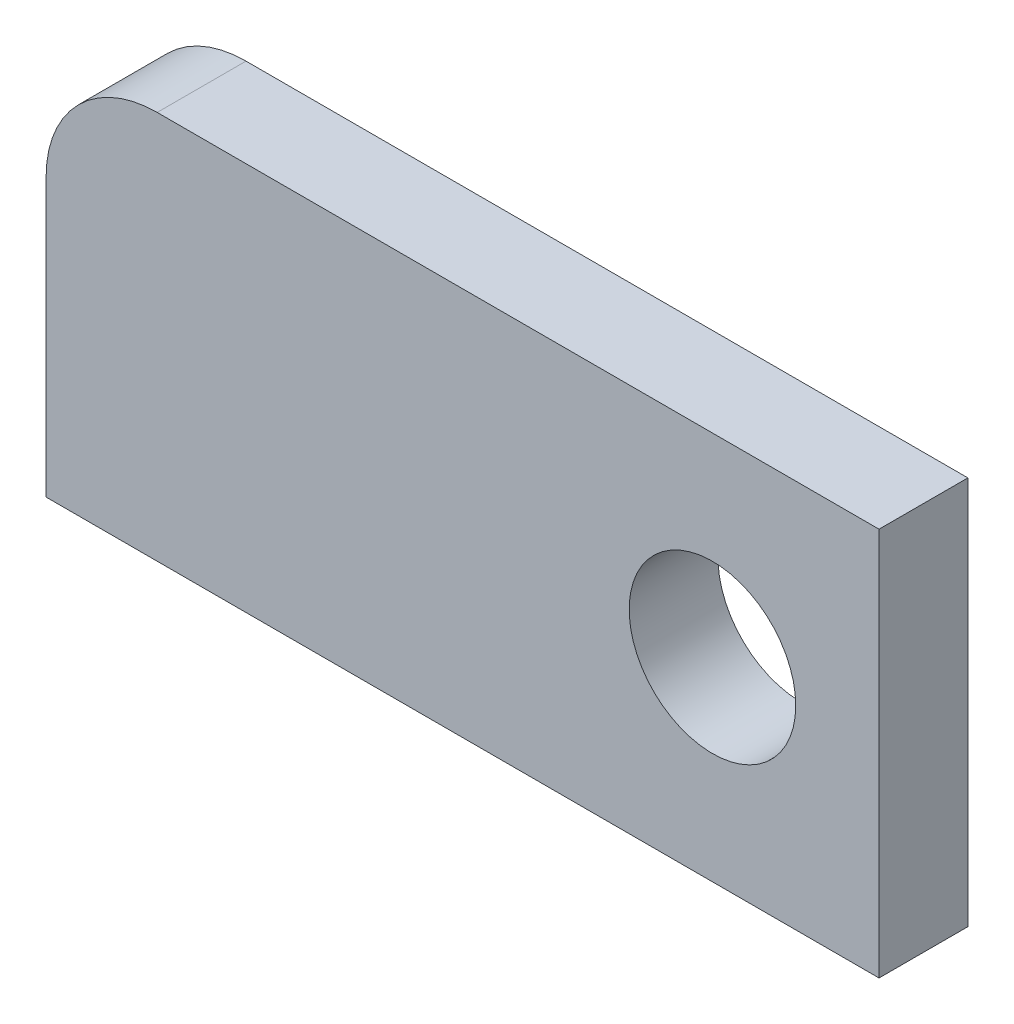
ISO-10303-21;
HEADER;
FILE_DESCRIPTION(('STEP AP214'),'2;1');
FILE_NAME('part.step','',(''),(''),'','','');
FILE_SCHEMA(('AUTOMOTIVE_DESIGN { 1 0 10303 214 1 1 1 1 }'));
ENDSEC;
DATA;
#1=APPLICATION_CONTEXT('core data for automotive mechanical design processes');
#2=APPLICATION_PROTOCOL_DEFINITION('international standard','automotive_design',2000,#1);
#3=PRODUCT_CONTEXT('',#1,'mechanical');
#4=PRODUCT('Part','Part','',(#3));
#5=PRODUCT_RELATED_PRODUCT_CATEGORY('part','',(#4));
#6=PRODUCT_DEFINITION_FORMATION('','',#4);
#7=PRODUCT_DEFINITION_CONTEXT('part definition',#1,'design');
#8=PRODUCT_DEFINITION('design','',#6,#7);
#9=PRODUCT_DEFINITION_SHAPE('','',#8);
#10=(LENGTH_UNIT() NAMED_UNIT(*) SI_UNIT(.MILLI.,.METRE.));
#11=(NAMED_UNIT(*) PLANE_ANGLE_UNIT() SI_UNIT($,.RADIAN.));
#12=(NAMED_UNIT(*) SI_UNIT($,.STERADIAN.) SOLID_ANGLE_UNIT());
#13=UNCERTAINTY_MEASURE_WITH_UNIT(LENGTH_MEASURE(1.E-05),#10,'distance_accuracy_value','');
#14=(GEOMETRIC_REPRESENTATION_CONTEXT(3) GLOBAL_UNCERTAINTY_ASSIGNED_CONTEXT((#13)) GLOBAL_UNIT_ASSIGNED_CONTEXT((#10,
#11,#12)) REPRESENTATION_CONTEXT('',''));
#15=CARTESIAN_POINT('',(0.,0.,0.));
#16=DIRECTION('',(0.,0.,1.));
#17=DIRECTION('',(1.,0.,0.));
#18=AXIS2_PLACEMENT_3D('',#15,#16,#17);
#19=CARTESIAN_POINT('',(10.,25.,8.));
#20=DIRECTION('',(0.,0.,-1.));
#21=DIRECTION('',(-1.,0.,0.));
#22=AXIS2_PLACEMENT_3D('',#19,#20,#21);
#23=PLANE('',#22);
#24=DIRECTION('',(0.,-1.,0.));
#25=VECTOR('',#24,1.);
#26=CARTESIAN_POINT('',(0.,0.,8.));
#27=LINE('',#26,#25);
#28=CARTESIAN_POINT('',(0.,24.9999999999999,8.));
#29=VERTEX_POINT('',#28);
#30=CARTESIAN_POINT('',(0.,0.,8.));
#31=VERTEX_POINT('',#30);
#32=EDGE_CURVE('E109',#29,#31,#27,.T.);
#33=ORIENTED_EDGE('',*,*,#32,.T.);
#34=DIRECTION('',(1.,0.,0.));
#35=VECTOR('',#34,1.);
#36=CARTESIAN_POINT('',(0.,0.,8.));
#37=LINE('',#36,#35);
#38=CARTESIAN_POINT('',(75.,0.,8.));
#39=VERTEX_POINT('',#38);
#40=EDGE_CURVE('E92',#31,#39,#37,.T.);
#41=ORIENTED_EDGE('',*,*,#40,.T.);
#42=DIRECTION('',(0.,1.,0.));
#43=VECTOR('',#42,1.);
#44=CARTESIAN_POINT('',(75.,0.,8.));
#45=LINE('',#44,#43);
#46=CARTESIAN_POINT('',(75.,35.,8.));
#47=VERTEX_POINT('',#46);
#48=EDGE_CURVE('E112',#39,#47,#45,.T.);
#49=ORIENTED_EDGE('',*,*,#48,.T.);
#50=DIRECTION('',(-1.,0.,0.));
#51=VECTOR('',#50,1.);
#52=CARTESIAN_POINT('',(10.0000000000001,35.,8.));
#53=LINE('',#52,#51);
#54=CARTESIAN_POINT('',(10.0000000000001,35.,8.));
#55=VERTEX_POINT('',#54);
#56=EDGE_CURVE('E51',#47,#55,#53,.T.);
#57=ORIENTED_EDGE('',*,*,#56,.T.);
#58=CARTESIAN_POINT('',(10.,25.,8.));
#59=DIRECTION('',(0.,0.,1.));
#60=DIRECTION('',(-1.,0.,0.));
#61=AXIS2_PLACEMENT_3D('',#58,#59,#60);
#62=CIRCLE('',#61,10.);
#63=EDGE_CURVE('E46',#55,#29,#62,.T.);
#64=ORIENTED_EDGE('',*,*,#63,.T.);
#65=EDGE_LOOP('',(#33,#41,#49,#57,#64));
#66=FACE_BOUND('',#65,.T.);
#67=CARTESIAN_POINT('',(60.,17.5,8.));
#68=DIRECTION('',(0.,0.,1.));
#69=DIRECTION('',(1.,0.,0.));
#70=AXIS2_PLACEMENT_3D('',#67,#68,#69);
#71=CIRCLE('',#70,7.50000000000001);
#72=CARTESIAN_POINT('',(67.5,17.5,8.));
#73=VERTEX_POINT('',#72);
#74=EDGE_CURVE('E97',#73,#73,#71,.T.);
#75=ORIENTED_EDGE('',*,*,#74,.F.);
#76=EDGE_LOOP('',(#75));
#77=FACE_BOUND('',#76,.T.);
#78=ADVANCED_FACE('F31',(#66,#77),#23,.F.);
#79=CARTESIAN_POINT('',(10.,25.,0.));
#80=DIRECTION('',(0.,0.,-1.));
#81=DIRECTION('',(-1.,0.,0.));
#82=AXIS2_PLACEMENT_3D('',#79,#80,#81);
#83=PLANE('',#82);
#84=DIRECTION('',(0.,-1.,0.));
#85=VECTOR('',#84,1.);
#86=CARTESIAN_POINT('',(0.,0.,0.));
#87=LINE('',#86,#85);
#88=CARTESIAN_POINT('',(0.,24.9999999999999,0.));
#89=VERTEX_POINT('',#88);
#90=CARTESIAN_POINT('',(0.,0.,0.));
#91=VERTEX_POINT('',#90);
#92=EDGE_CURVE('E83',#89,#91,#87,.T.);
#93=ORIENTED_EDGE('',*,*,#92,.F.);
#94=CARTESIAN_POINT('',(10.,25.,0.));
#95=DIRECTION('',(0.,0.,1.));
#96=DIRECTION('',(-1.,0.,0.));
#97=AXIS2_PLACEMENT_3D('',#94,#95,#96);
#98=CIRCLE('',#97,10.);
#99=CARTESIAN_POINT('',(10.0000000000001,35.,0.));
#100=VERTEX_POINT('',#99);
#101=EDGE_CURVE('E107',#100,#89,#98,.T.);
#102=ORIENTED_EDGE('',*,*,#101,.F.);
#103=DIRECTION('',(-1.,0.,0.));
#104=VECTOR('',#103,1.);
#105=CARTESIAN_POINT('',(10.0000000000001,35.,0.));
#106=LINE('',#105,#104);
#107=CARTESIAN_POINT('',(75.,35.,0.));
#108=VERTEX_POINT('',#107);
#109=EDGE_CURVE('E105',#108,#100,#106,.T.);
#110=ORIENTED_EDGE('',*,*,#109,.F.);
#111=DIRECTION('',(0.,1.,0.));
#112=VECTOR('',#111,1.);
#113=CARTESIAN_POINT('',(75.,0.,0.));
#114=LINE('',#113,#112);
#115=CARTESIAN_POINT('',(75.,0.,0.));
#116=VERTEX_POINT('',#115);
#117=EDGE_CURVE('E85',#116,#108,#114,.T.);
#118=ORIENTED_EDGE('',*,*,#117,.F.);
#119=DIRECTION('',(1.,0.,0.));
#120=VECTOR('',#119,1.);
#121=CARTESIAN_POINT('',(0.,0.,0.));
#122=LINE('',#121,#120);
#123=EDGE_CURVE('E78',#91,#116,#122,.T.);
#124=ORIENTED_EDGE('',*,*,#123,.F.);
#125=EDGE_LOOP('',(#93,#102,#110,#118,#124));
#126=FACE_BOUND('',#125,.T.);
#127=CARTESIAN_POINT('',(60.,17.5,0.));
#128=DIRECTION('',(0.,0.,1.));
#129=DIRECTION('',(1.,0.,0.));
#130=AXIS2_PLACEMENT_3D('',#127,#128,#129);
#131=CIRCLE('',#130,7.50000000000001);
#132=CARTESIAN_POINT('',(67.5,17.5,0.));
#133=VERTEX_POINT('',#132);
#134=EDGE_CURVE('E100',#133,#133,#131,.T.);
#135=ORIENTED_EDGE('',*,*,#134,.T.);
#136=EDGE_LOOP('',(#135));
#137=FACE_BOUND('',#136,.T.);
#138=ADVANCED_FACE('F79',(#126,#137),#83,.T.);
#139=CARTESIAN_POINT('',(0.,0.,8.));
#140=DIRECTION('',(1.,0.,0.));
#141=DIRECTION('',(0.,0.,-1.));
#142=AXIS2_PLACEMENT_3D('',#139,#140,#141);
#143=PLANE('',#142);
#144=ORIENTED_EDGE('',*,*,#92,.T.);
#145=DIRECTION('',(0.,0.,-1.));
#146=VECTOR('',#145,1.);
#147=CARTESIAN_POINT('',(0.,0.,8.));
#148=LINE('',#147,#146);
#149=EDGE_CURVE('E11',#31,#91,#148,.T.);
#150=ORIENTED_EDGE('',*,*,#149,.F.);
#151=ORIENTED_EDGE('',*,*,#32,.F.);
#152=DIRECTION('',(0.,0.,-1.));
#153=VECTOR('',#152,1.);
#154=CARTESIAN_POINT('',(0.,24.9999999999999,8.));
#155=LINE('',#154,#153);
#156=EDGE_CURVE('E96',#29,#89,#155,.T.);
#157=ORIENTED_EDGE('',*,*,#156,.T.);
#158=EDGE_LOOP('',(#144,#150,#151,#157));
#159=FACE_BOUND('',#158,.T.);
#160=ADVANCED_FACE('F33',(#159),#143,.F.);
#161=CARTESIAN_POINT('',(0.,0.,8.));
#162=DIRECTION('',(0.,1.,0.));
#163=DIRECTION('',(0.,0.,1.));
#164=AXIS2_PLACEMENT_3D('',#161,#162,#163);
#165=PLANE('',#164);
#166=ORIENTED_EDGE('',*,*,#123,.T.);
#167=DIRECTION('',(0.,0.,-1.));
#168=VECTOR('',#167,1.);
#169=CARTESIAN_POINT('',(75.,0.,8.));
#170=LINE('',#169,#168);
#171=EDGE_CURVE('E39',#39,#116,#170,.T.);
#172=ORIENTED_EDGE('',*,*,#171,.F.);
#173=ORIENTED_EDGE('',*,*,#40,.F.);
#174=ORIENTED_EDGE('',*,*,#149,.T.);
#175=EDGE_LOOP('',(#166,#172,#173,#174));
#176=FACE_BOUND('',#175,.T.);
#177=ADVANCED_FACE('F91',(#176),#165,.F.);
#178=CARTESIAN_POINT('',(75.,0.,8.));
#179=DIRECTION('',(-1.,0.,0.));
#180=DIRECTION('',(0.,0.,1.));
#181=AXIS2_PLACEMENT_3D('',#178,#179,#180);
#182=PLANE('',#181);
#183=ORIENTED_EDGE('',*,*,#117,.T.);
#184=DIRECTION('',(0.,0.,-1.));
#185=VECTOR('',#184,1.);
#186=CARTESIAN_POINT('',(75.,35.,8.));
#187=LINE('',#186,#185);
#188=EDGE_CURVE('E120',#47,#108,#187,.T.);
#189=ORIENTED_EDGE('',*,*,#188,.F.);
#190=ORIENTED_EDGE('',*,*,#48,.F.);
#191=ORIENTED_EDGE('',*,*,#171,.T.);
#192=EDGE_LOOP('',(#183,#189,#190,#191));
#193=FACE_BOUND('',#192,.T.);
#194=ADVANCED_FACE('F124',(#193),#182,.F.);
#195=CARTESIAN_POINT('',(10.0000000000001,35.,8.));
#196=DIRECTION('',(0.,-1.,0.));
#197=DIRECTION('',(0.,0.,-1.));
#198=AXIS2_PLACEMENT_3D('',#195,#196,#197);
#199=PLANE('',#198);
#200=ORIENTED_EDGE('',*,*,#109,.T.);
#201=DIRECTION('',(0.,0.,-1.));
#202=VECTOR('',#201,1.);
#203=CARTESIAN_POINT('',(10.0000000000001,35.,8.));
#204=LINE('',#203,#202);
#205=EDGE_CURVE('E117',#55,#100,#204,.T.);
#206=ORIENTED_EDGE('',*,*,#205,.F.);
#207=ORIENTED_EDGE('',*,*,#56,.F.);
#208=ORIENTED_EDGE('',*,*,#188,.T.);
#209=EDGE_LOOP('',(#200,#206,#207,#208));
#210=FACE_BOUND('',#209,.T.);
#211=ADVANCED_FACE('F146',(#210),#199,.F.);
#212=CARTESIAN_POINT('',(10.,25.,8.));
#213=DIRECTION('',(0.,0.,-1.));
#214=DIRECTION('',(-1.,0.,0.));
#215=AXIS2_PLACEMENT_3D('',#212,#213,#214);
#216=CYLINDRICAL_SURFACE('',#215,10.);
#217=ORIENTED_EDGE('',*,*,#101,.T.);
#218=ORIENTED_EDGE('',*,*,#156,.F.);
#219=ORIENTED_EDGE('',*,*,#63,.F.);
#220=ORIENTED_EDGE('',*,*,#205,.T.);
#221=EDGE_LOOP('',(#217,#218,#219,#220));
#222=FACE_BOUND('',#221,.T.);
#223=ADVANCED_FACE('F134',(#222),#216,.T.);
#224=CARTESIAN_POINT('',(60.,17.5,8.));
#225=DIRECTION('',(0.,0.,-1.));
#226=DIRECTION('',(-1.,0.,0.));
#227=AXIS2_PLACEMENT_3D('',#224,#225,#226);
#228=CYLINDRICAL_SURFACE('',#227,7.50000000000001);
#229=ORIENTED_EDGE('',*,*,#74,.T.);
#230=EDGE_LOOP('',(#229));
#231=FACE_BOUND('',#230,.T.);
#232=ORIENTED_EDGE('',*,*,#134,.F.);
#233=EDGE_LOOP('',(#232));
#234=FACE_BOUND('',#233,.T.);
#235=ADVANCED_FACE('F131',(#231,#234),#228,.F.);
#236=CLOSED_SHELL('',(#78,#138,#160,#177,#194,#211,#223,#235));
#237=MANIFOLD_SOLID_BREP('B2',#236);
#238=ADVANCED_BREP_SHAPE_REPRESENTATION('',(#18,#237),#14);
#239=SHAPE_DEFINITION_REPRESENTATION(#9,#238);
ENDSEC;
END-ISO-10303-21;
